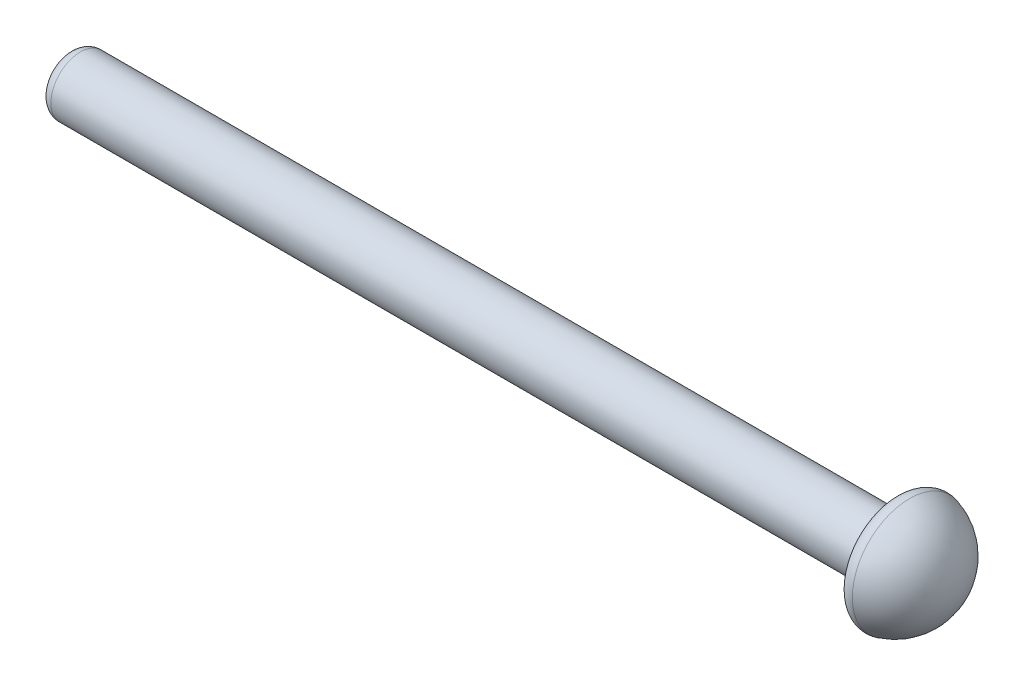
ISO-10303-21;
HEADER;
FILE_DESCRIPTION(('STEP AP214'),'2;1');
FILE_NAME('part.step','',(''),(''),'','','');
FILE_SCHEMA(('AUTOMOTIVE_DESIGN { 1 0 10303 214 1 1 1 1 }'));
ENDSEC;
DATA;
#1=APPLICATION_CONTEXT('core data for automotive mechanical design processes');
#2=APPLICATION_PROTOCOL_DEFINITION('international standard','automotive_design',2000,#1);
#3=PRODUCT_CONTEXT('',#1,'mechanical');
#4=PRODUCT('Part','Part','',(#3));
#5=PRODUCT_RELATED_PRODUCT_CATEGORY('part','',(#4));
#6=PRODUCT_DEFINITION_FORMATION('','',#4);
#7=PRODUCT_DEFINITION_CONTEXT('part definition',#1,'design');
#8=PRODUCT_DEFINITION('design','',#6,#7);
#9=PRODUCT_DEFINITION_SHAPE('','',#8);
#10=(LENGTH_UNIT() NAMED_UNIT(*) SI_UNIT(.MILLI.,.METRE.));
#11=(NAMED_UNIT(*) PLANE_ANGLE_UNIT() SI_UNIT($,.RADIAN.));
#12=(NAMED_UNIT(*) SI_UNIT($,.STERADIAN.) SOLID_ANGLE_UNIT());
#13=UNCERTAINTY_MEASURE_WITH_UNIT(LENGTH_MEASURE(1.E-05),#10,'distance_accuracy_value','');
#14=(GEOMETRIC_REPRESENTATION_CONTEXT(3) GLOBAL_UNCERTAINTY_ASSIGNED_CONTEXT((#13)) GLOBAL_UNIT_ASSIGNED_CONTEXT((#10,
#11,#12)) REPRESENTATION_CONTEXT('',''));
#15=CARTESIAN_POINT('',(0.,0.,0.));
#16=DIRECTION('',(0.,0.,1.));
#17=DIRECTION('',(1.,0.,0.));
#18=AXIS2_PLACEMENT_3D('',#15,#16,#17);
#19=CARTESIAN_POINT('',(-7.5,0.,0.));
#20=DIRECTION('',(1.,0.,0.));
#21=DIRECTION('',(0.,1.,0.));
#22=AXIS2_PLACEMENT_3D('',#19,#20,#21);
#23=PLANE('',#22);
#24=CARTESIAN_POINT('',(-7.5,0.,0.));
#25=DIRECTION('',(1.,0.,0.));
#26=DIRECTION('',(0.,1.,0.));
#27=AXIS2_PLACEMENT_3D('',#24,#25,#26);
#28=CIRCLE('',#27,0.3);
#29=CARTESIAN_POINT('',(-7.5,0.3,0.));
#30=VERTEX_POINT('',#29);
#31=EDGE_CURVE('E35',#30,#30,#28,.F.);
#32=ORIENTED_EDGE('',*,*,#31,.T.);
#33=EDGE_LOOP('',(#32));
#34=FACE_BOUND('',#33,.T.);
#35=ADVANCED_FACE('F28',(#34),#23,.F.);
#36=CARTESIAN_POINT('',(6.5,0.,0.));
#37=DIRECTION('',(-1.,0.,0.));
#38=DIRECTION('',(0.,-1.,0.));
#39=AXIS2_PLACEMENT_3D('',#36,#37,#38);
#40=SPHERICAL_SURFACE('',#39,1.);
#41=CARTESIAN_POINT('',(6.75,0.,0.));
#42=DIRECTION('',(-1.,0.,0.));
#43=DIRECTION('',(0.,-1.,0.));
#44=AXIS2_PLACEMENT_3D('',#41,#42,#43);
#45=CIRCLE('',#44,0.968245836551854);
#46=CARTESIAN_POINT('',(6.75,-0.968245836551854,0.));
#47=VERTEX_POINT('',#46);
#48=EDGE_CURVE('E39',#47,#47,#45,.F.);
#49=ORIENTED_EDGE('',*,*,#48,.T.);
#50=EDGE_LOOP('',(#49));
#51=FACE_BOUND('',#50,.T.);
#52=ADVANCED_FACE('F56',(#51),#40,.T.);
#53=CARTESIAN_POINT('',(6.5,0.5,0.));
#54=DIRECTION('',(1.,0.,0.));
#55=DIRECTION('',(0.,1.,0.));
#56=AXIS2_PLACEMENT_3D('',#53,#54,#55);
#57=PLANE('',#56);
#58=CARTESIAN_POINT('',(6.5,0.,0.));
#59=DIRECTION('',(1.,0.,0.));
#60=DIRECTION('',(0.,1.,0.));
#61=AXIS2_PLACEMENT_3D('',#58,#59,#60);
#62=CIRCLE('',#61,0.774596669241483);
#63=CARTESIAN_POINT('',(6.5,0.774596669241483,0.));
#64=VERTEX_POINT('',#63);
#65=EDGE_CURVE('E43',#64,#64,#62,.F.);
#66=ORIENTED_EDGE('',*,*,#65,.T.);
#67=EDGE_LOOP('',(#66));
#68=FACE_BOUND('',#67,.T.);
#69=CARTESIAN_POINT('',(6.5,0.,0.));
#70=DIRECTION('',(-1.,0.,0.));
#71=DIRECTION('',(0.,-1.,0.));
#72=AXIS2_PLACEMENT_3D('',#69,#70,#71);
#73=CIRCLE('',#72,0.500000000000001);
#74=CARTESIAN_POINT('',(6.5,-0.500000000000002,0.));
#75=VERTEX_POINT('',#74);
#76=EDGE_CURVE('E48',#75,#75,#73,.T.);
#77=ORIENTED_EDGE('',*,*,#76,.F.);
#78=EDGE_LOOP('',(#77));
#79=FACE_BOUND('',#78,.T.);
#80=ADVANCED_FACE('F54',(#68,#79),#57,.F.);
#81=CARTESIAN_POINT('',(-7.5,0.,0.));
#82=DIRECTION('',(-1.,0.,0.));
#83=DIRECTION('',(0.,-1.,0.));
#84=AXIS2_PLACEMENT_3D('',#81,#82,#83);
#85=CYLINDRICAL_SURFACE('',#84,0.5);
#86=CARTESIAN_POINT('',(-7.3,0.,0.));
#87=DIRECTION('',(1.,0.,0.));
#88=DIRECTION('',(0.,1.,0.));
#89=AXIS2_PLACEMENT_3D('',#86,#87,#88);
#90=CIRCLE('',#89,0.5);
#91=CARTESIAN_POINT('',(-7.3,0.5,0.));
#92=VERTEX_POINT('',#91);
#93=EDGE_CURVE('E10',#92,#92,#90,.T.);
#94=ORIENTED_EDGE('',*,*,#93,.T.);
#95=EDGE_LOOP('',(#94));
#96=FACE_BOUND('',#95,.T.);
#97=ORIENTED_EDGE('',*,*,#76,.T.);
#98=EDGE_LOOP('',(#97));
#99=FACE_BOUND('',#98,.T.);
#100=ADVANCED_FACE('F52',(#96,#99),#85,.T.);
#101=CARTESIAN_POINT('',(6.7,0.,0.));
#102=DIRECTION('',(1.,0.,0.));
#103=DIRECTION('',(0.,1.,0.));
#104=AXIS2_PLACEMENT_3D('',#101,#102,#103);
#105=TOROIDAL_SURFACE('',#104,0.774596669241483,0.2);
#106=ORIENTED_EDGE('',*,*,#48,.F.);
#107=EDGE_LOOP('',(#106));
#108=FACE_BOUND('',#107,.T.);
#109=ORIENTED_EDGE('',*,*,#65,.F.);
#110=EDGE_LOOP('',(#109));
#111=FACE_BOUND('',#110,.T.);
#112=ADVANCED_FACE('F63',(#108,#111),#105,.T.);
#113=CARTESIAN_POINT('',(-7.3,0.,0.));
#114=DIRECTION('',(1.,0.,0.));
#115=DIRECTION('',(0.,1.,0.));
#116=AXIS2_PLACEMENT_3D('',#113,#114,#115);
#117=TOROIDAL_SURFACE('',#116,0.3,0.2);
#118=ORIENTED_EDGE('',*,*,#93,.F.);
#119=EDGE_LOOP('',(#118));
#120=FACE_BOUND('',#119,.T.);
#121=ORIENTED_EDGE('',*,*,#31,.F.);
#122=EDGE_LOOP('',(#121));
#123=FACE_BOUND('',#122,.T.);
#124=ADVANCED_FACE('F30',(#120,#123),#117,.T.);
#125=CLOSED_SHELL('',(#35,#52,#80,#100,#112,#124));
#126=MANIFOLD_SOLID_BREP('B2',#125);
#127=ADVANCED_BREP_SHAPE_REPRESENTATION('',(#18,#126),#14);
#128=SHAPE_DEFINITION_REPRESENTATION(#9,#127);
ENDSEC;
END-ISO-10303-21;
